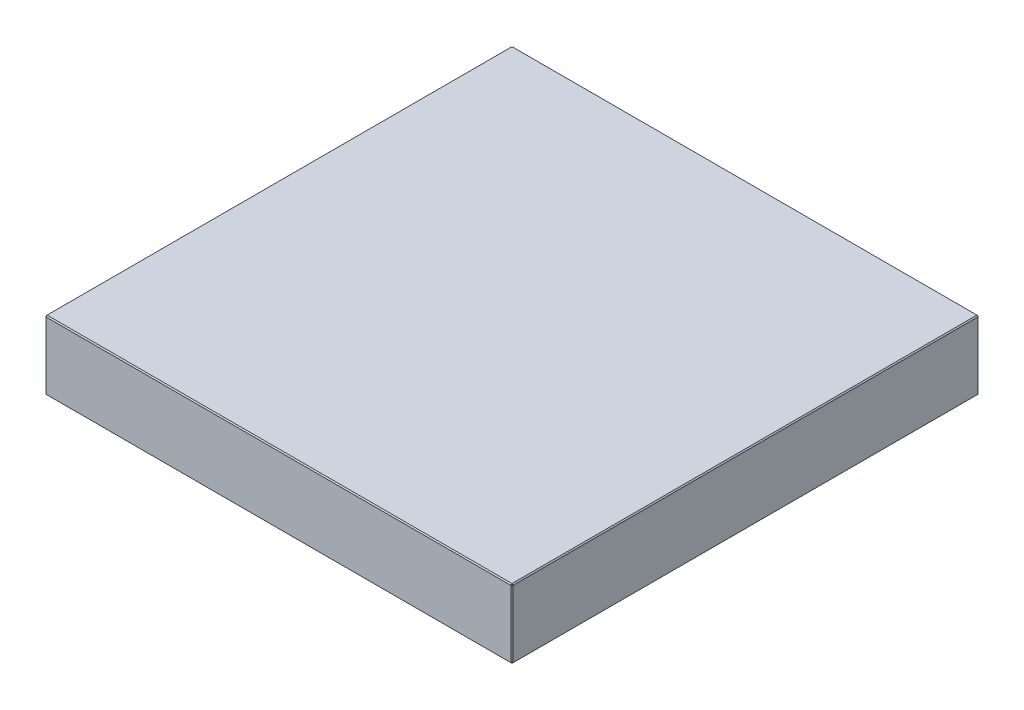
ISO-10303-21;
HEADER;
FILE_DESCRIPTION(('STEP AP214'),'2;1');
FILE_NAME('part.step','',(''),(''),'','','');
FILE_SCHEMA(('AUTOMOTIVE_DESIGN { 1 0 10303 214 1 1 1 1 }'));
ENDSEC;
DATA;
#1=APPLICATION_CONTEXT('core data for automotive mechanical design processes');
#2=APPLICATION_PROTOCOL_DEFINITION('international standard','automotive_design',2000,#1);
#3=PRODUCT_CONTEXT('',#1,'mechanical');
#4=PRODUCT('Part','Part','',(#3));
#5=PRODUCT_RELATED_PRODUCT_CATEGORY('part','',(#4));
#6=PRODUCT_DEFINITION_FORMATION('','',#4);
#7=PRODUCT_DEFINITION_CONTEXT('part definition',#1,'design');
#8=PRODUCT_DEFINITION('design','',#6,#7);
#9=PRODUCT_DEFINITION_SHAPE('','',#8);
#10=(LENGTH_UNIT() NAMED_UNIT(*) SI_UNIT(.MILLI.,.METRE.));
#11=(NAMED_UNIT(*) PLANE_ANGLE_UNIT() SI_UNIT($,.RADIAN.));
#12=(NAMED_UNIT(*) SI_UNIT($,.STERADIAN.) SOLID_ANGLE_UNIT());
#13=UNCERTAINTY_MEASURE_WITH_UNIT(LENGTH_MEASURE(1.E-05),#10,'distance_accuracy_value','');
#14=(GEOMETRIC_REPRESENTATION_CONTEXT(3) GLOBAL_UNCERTAINTY_ASSIGNED_CONTEXT((#13)) GLOBAL_UNIT_ASSIGNED_CONTEXT((#10,
#11,#12)) REPRESENTATION_CONTEXT('',''));
#15=CARTESIAN_POINT('',(0.,0.,0.));
#16=DIRECTION('',(0.,0.,1.));
#17=DIRECTION('',(1.,0.,0.));
#18=AXIS2_PLACEMENT_3D('',#15,#16,#17);
#19=CARTESIAN_POINT('',(-223.,66.,223.));
#20=DIRECTION('',(1.,0.,0.));
#21=DIRECTION('',(0.,0.,-1.));
#22=AXIS2_PLACEMENT_3D('',#19,#20,#21);
#23=PLANE('',#22);
#24=DIRECTION('',(0.,-1.,0.));
#25=VECTOR('',#24,1.);
#26=CARTESIAN_POINT('',(-223.,66.,-222.));
#27=LINE('',#26,#25);
#28=CARTESIAN_POINT('',(-223.,65.,-222.));
#29=VERTEX_POINT('',#28);
#30=CARTESIAN_POINT('',(-223.,1.,-222.));
#31=VERTEX_POINT('',#30);
#32=EDGE_CURVE('E114',#29,#31,#27,.T.);
#33=ORIENTED_EDGE('',*,*,#32,.T.);
#34=DIRECTION('',(0.,0.,1.));
#35=VECTOR('',#34,1.);
#36=CARTESIAN_POINT('',(-223.,1.,223.));
#37=LINE('',#36,#35);
#38=CARTESIAN_POINT('',(-223.,1.,222.));
#39=VERTEX_POINT('',#38);
#40=EDGE_CURVE('E110',#31,#39,#37,.T.);
#41=ORIENTED_EDGE('',*,*,#40,.T.);
#42=DIRECTION('',(0.,1.,0.));
#43=VECTOR('',#42,1.);
#44=CARTESIAN_POINT('',(-223.,66.,222.));
#45=LINE('',#44,#43);
#46=CARTESIAN_POINT('',(-223.,65.,222.));
#47=VERTEX_POINT('',#46);
#48=EDGE_CURVE('E103',#39,#47,#45,.T.);
#49=ORIENTED_EDGE('',*,*,#48,.T.);
#50=DIRECTION('',(0.,0.,-1.));
#51=VECTOR('',#50,1.);
#52=CARTESIAN_POINT('',(-223.,65.,-223.));
#53=LINE('',#52,#51);
#54=EDGE_CURVE('E107',#47,#29,#53,.T.);
#55=ORIENTED_EDGE('',*,*,#54,.T.);
#56=EDGE_LOOP('',(#33,#41,#49,#55));
#57=FACE_BOUND('',#56,.T.);
#58=ADVANCED_FACE('F15',(#57),#23,.F.);
#59=CARTESIAN_POINT('',(223.,66.,223.));
#60=DIRECTION('',(0.,0.,-1.));
#61=DIRECTION('',(-1.,0.,0.));
#62=AXIS2_PLACEMENT_3D('',#59,#60,#61);
#63=PLANE('',#62);
#64=DIRECTION('',(-1.,0.,0.));
#65=VECTOR('',#64,1.);
#66=CARTESIAN_POINT('',(-223.,65.,223.));
#67=LINE('',#66,#65);
#68=CARTESIAN_POINT('',(222.,65.,223.));
#69=VERTEX_POINT('',#68);
#70=CARTESIAN_POINT('',(-222.,65.,223.));
#71=VERTEX_POINT('',#70);
#72=EDGE_CURVE('E164',#69,#71,#67,.T.);
#73=ORIENTED_EDGE('',*,*,#72,.T.);
#74=DIRECTION('',(0.,-1.,0.));
#75=VECTOR('',#74,1.);
#76=CARTESIAN_POINT('',(-222.,66.,223.));
#77=LINE('',#76,#75);
#78=CARTESIAN_POINT('',(-222.,1.,223.));
#79=VERTEX_POINT('',#78);
#80=EDGE_CURVE('E122',#71,#79,#77,.T.);
#81=ORIENTED_EDGE('',*,*,#80,.T.);
#82=DIRECTION('',(1.,0.,0.));
#83=VECTOR('',#82,1.);
#84=CARTESIAN_POINT('',(223.,1.,223.));
#85=LINE('',#84,#83);
#86=CARTESIAN_POINT('',(222.,1.,223.));
#87=VERTEX_POINT('',#86);
#88=EDGE_CURVE('E168',#79,#87,#85,.T.);
#89=ORIENTED_EDGE('',*,*,#88,.T.);
#90=DIRECTION('',(0.,1.,0.));
#91=VECTOR('',#90,1.);
#92=CARTESIAN_POINT('',(222.,66.,223.));
#93=LINE('',#92,#91);
#94=EDGE_CURVE('E166',#87,#69,#93,.T.);
#95=ORIENTED_EDGE('',*,*,#94,.T.);
#96=EDGE_LOOP('',(#73,#81,#89,#95));
#97=FACE_BOUND('',#96,.T.);
#98=ADVANCED_FACE('F275',(#97),#63,.F.);
#99=CARTESIAN_POINT('',(223.,66.,223.));
#100=DIRECTION('',(-1.,0.,0.));
#101=DIRECTION('',(0.,0.,1.));
#102=AXIS2_PLACEMENT_3D('',#99,#100,#101);
#103=PLANE('',#102);
#104=DIRECTION('',(0.,0.,-1.));
#105=VECTOR('',#104,1.);
#106=CARTESIAN_POINT('',(223.,1.,223.));
#107=LINE('',#106,#105);
#108=CARTESIAN_POINT('',(223.,1.,222.));
#109=VERTEX_POINT('',#108);
#110=CARTESIAN_POINT('',(223.,1.,-222.));
#111=VERTEX_POINT('',#110);
#112=EDGE_CURVE('E159',#109,#111,#107,.T.);
#113=ORIENTED_EDGE('',*,*,#112,.T.);
#114=DIRECTION('',(0.,1.,0.));
#115=VECTOR('',#114,1.);
#116=CARTESIAN_POINT('',(223.,66.,-222.));
#117=LINE('',#116,#115);
#118=CARTESIAN_POINT('',(223.,65.,-222.));
#119=VERTEX_POINT('',#118);
#120=EDGE_CURVE('E161',#111,#119,#117,.T.);
#121=ORIENTED_EDGE('',*,*,#120,.T.);
#122=DIRECTION('',(0.,0.,1.));
#123=VECTOR('',#122,1.);
#124=CARTESIAN_POINT('',(223.,65.,223.));
#125=LINE('',#124,#123);
#126=CARTESIAN_POINT('',(223.,65.,222.));
#127=VERTEX_POINT('',#126);
#128=EDGE_CURVE('E155',#119,#127,#125,.T.);
#129=ORIENTED_EDGE('',*,*,#128,.T.);
#130=DIRECTION('',(0.,-1.,0.));
#131=VECTOR('',#130,1.);
#132=CARTESIAN_POINT('',(223.,66.,222.));
#133=LINE('',#132,#131);
#134=EDGE_CURVE('E157',#127,#109,#133,.T.);
#135=ORIENTED_EDGE('',*,*,#134,.T.);
#136=EDGE_LOOP('',(#113,#121,#129,#135));
#137=FACE_BOUND('',#136,.T.);
#138=ADVANCED_FACE('F254',(#137),#103,.F.);
#139=CARTESIAN_POINT('',(223.,66.,-223.));
#140=DIRECTION('',(0.,0.,1.));
#141=DIRECTION('',(1.,0.,0.));
#142=AXIS2_PLACEMENT_3D('',#139,#140,#141);
#143=PLANE('',#142);
#144=DIRECTION('',(0.,-1.,0.));
#145=VECTOR('',#144,1.);
#146=CARTESIAN_POINT('',(222.,66.,-223.));
#147=LINE('',#146,#145);
#148=CARTESIAN_POINT('',(222.,65.,-223.));
#149=VERTEX_POINT('',#148);
#150=CARTESIAN_POINT('',(222.,1.,-223.));
#151=VERTEX_POINT('',#150);
#152=EDGE_CURVE('E148',#149,#151,#147,.T.);
#153=ORIENTED_EDGE('',*,*,#152,.T.);
#154=DIRECTION('',(-1.,0.,0.));
#155=VECTOR('',#154,1.);
#156=CARTESIAN_POINT('',(223.,1.,-223.));
#157=LINE('',#156,#155);
#158=CARTESIAN_POINT('',(-222.,1.,-223.));
#159=VERTEX_POINT('',#158);
#160=EDGE_CURVE('E153',#151,#159,#157,.T.);
#161=ORIENTED_EDGE('',*,*,#160,.T.);
#162=DIRECTION('',(0.,1.,0.));
#163=VECTOR('',#162,1.);
#164=CARTESIAN_POINT('',(-222.,66.,-223.));
#165=LINE('',#164,#163);
#166=CARTESIAN_POINT('',(-222.,65.,-223.));
#167=VERTEX_POINT('',#166);
#168=EDGE_CURVE('E150',#159,#167,#165,.T.);
#169=ORIENTED_EDGE('',*,*,#168,.T.);
#170=DIRECTION('',(1.,0.,0.));
#171=VECTOR('',#170,1.);
#172=CARTESIAN_POINT('',(223.,65.,-223.));
#173=LINE('',#172,#171);
#174=EDGE_CURVE('E146',#167,#149,#173,.T.);
#175=ORIENTED_EDGE('',*,*,#174,.T.);
#176=EDGE_LOOP('',(#153,#161,#169,#175));
#177=FACE_BOUND('',#176,.T.);
#178=ADVANCED_FACE('F284',(#177),#143,.F.);
#179=CARTESIAN_POINT('',(0.,66.,0.));
#180=DIRECTION('',(0.,1.,0.));
#181=DIRECTION('',(0.,0.,1.));
#182=AXIS2_PLACEMENT_3D('',#179,#180,#181);
#183=PLANE('',#182);
#184=DIRECTION('',(0.,0.,-1.));
#185=VECTOR('',#184,1.);
#186=CARTESIAN_POINT('',(222.,66.,-223.));
#187=LINE('',#186,#185);
#188=CARTESIAN_POINT('',(222.,66.,222.));
#189=VERTEX_POINT('',#188);
#190=CARTESIAN_POINT('',(222.,66.,-222.));
#191=VERTEX_POINT('',#190);
#192=EDGE_CURVE('E24',#189,#191,#187,.T.);
#193=ORIENTED_EDGE('',*,*,#192,.T.);
#194=DIRECTION('',(-1.,0.,0.));
#195=VECTOR('',#194,1.);
#196=CARTESIAN_POINT('',(-223.,66.,-222.));
#197=LINE('',#196,#195);
#198=CARTESIAN_POINT('',(-222.,66.,-222.));
#199=VERTEX_POINT('',#198);
#200=EDGE_CURVE('E9',#191,#199,#197,.T.);
#201=ORIENTED_EDGE('',*,*,#200,.T.);
#202=DIRECTION('',(0.,0.,1.));
#203=VECTOR('',#202,1.);
#204=CARTESIAN_POINT('',(-222.,66.,223.));
#205=LINE('',#204,#203);
#206=CARTESIAN_POINT('',(-222.,66.,222.));
#207=VERTEX_POINT('',#206);
#208=EDGE_CURVE('E180',#199,#207,#205,.T.);
#209=ORIENTED_EDGE('',*,*,#208,.T.);
#210=DIRECTION('',(1.,0.,0.));
#211=VECTOR('',#210,1.);
#212=CARTESIAN_POINT('',(223.,66.,222.));
#213=LINE('',#212,#211);
#214=EDGE_CURVE('E35',#207,#189,#213,.T.);
#215=ORIENTED_EDGE('',*,*,#214,.T.);
#216=EDGE_LOOP('',(#193,#201,#209,#215));
#217=FACE_BOUND('',#216,.T.);
#218=ADVANCED_FACE('F350',(#217),#183,.T.);
#219=CARTESIAN_POINT('',(0.,0.,0.));
#220=DIRECTION('',(0.,1.,0.));
#221=DIRECTION('',(0.,0.,1.));
#222=AXIS2_PLACEMENT_3D('',#219,#220,#221);
#223=PLANE('',#222);
#224=DIRECTION('',(0.,0.,1.));
#225=VECTOR('',#224,1.);
#226=CARTESIAN_POINT('',(222.,0.,0.));
#227=LINE('',#226,#225);
#228=CARTESIAN_POINT('',(222.,0.,-222.));
#229=VERTEX_POINT('',#228);
#230=CARTESIAN_POINT('',(222.,0.,222.));
#231=VERTEX_POINT('',#230);
#232=EDGE_CURVE('E171',#229,#231,#227,.T.);
#233=ORIENTED_EDGE('',*,*,#232,.T.);
#234=DIRECTION('',(-1.,0.,0.));
#235=VECTOR('',#234,1.);
#236=CARTESIAN_POINT('',(0.,0.,222.));
#237=LINE('',#236,#235);
#238=CARTESIAN_POINT('',(-222.,0.,222.));
#239=VERTEX_POINT('',#238);
#240=EDGE_CURVE('E177',#231,#239,#237,.T.);
#241=ORIENTED_EDGE('',*,*,#240,.T.);
#242=DIRECTION('',(0.,0.,-1.));
#243=VECTOR('',#242,1.);
#244=CARTESIAN_POINT('',(-222.,0.,0.));
#245=LINE('',#244,#243);
#246=CARTESIAN_POINT('',(-222.,0.,-222.));
#247=VERTEX_POINT('',#246);
#248=EDGE_CURVE('E175',#239,#247,#245,.T.);
#249=ORIENTED_EDGE('',*,*,#248,.T.);
#250=DIRECTION('',(1.,0.,0.));
#251=VECTOR('',#250,1.);
#252=CARTESIAN_POINT('',(0.,0.,-222.));
#253=LINE('',#252,#251);
#254=EDGE_CURVE('E173',#247,#229,#253,.T.);
#255=ORIENTED_EDGE('',*,*,#254,.T.);
#256=EDGE_LOOP('',(#233,#241,#249,#255));
#257=FACE_BOUND('',#256,.T.);
#258=ADVANCED_FACE('F246',(#257),#223,.F.);
#259=CARTESIAN_POINT('',(223.,66.,222.));
#260=DIRECTION('',(-0.707106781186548,0.,-0.707106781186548));
#261=DIRECTION('',(0.,-1.,0.));
#262=AXIS2_PLACEMENT_3D('',#259,#260,#261);
#263=PLANE('',#262);
#264=DIRECTION('',(-0.707106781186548,0.,0.707106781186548));
#265=VECTOR('',#264,1.);
#266=CARTESIAN_POINT('',(222.,65.,223.));
#267=LINE('',#266,#265);
#268=EDGE_CURVE('E19',#69,#127,#267,.F.);
#269=ORIENTED_EDGE('',*,*,#268,.F.);
#270=ORIENTED_EDGE('',*,*,#94,.F.);
#271=DIRECTION('',(0.707106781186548,0.,-0.707106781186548));
#272=VECTOR('',#271,1.);
#273=CARTESIAN_POINT('',(222.,1.,223.));
#274=LINE('',#273,#272);
#275=EDGE_CURVE('E142',#109,#87,#274,.F.);
#276=ORIENTED_EDGE('',*,*,#275,.F.);
#277=ORIENTED_EDGE('',*,*,#134,.F.);
#278=EDGE_LOOP('',(#269,#270,#276,#277));
#279=FACE_BOUND('',#278,.T.);
#280=ADVANCED_FACE('F17',(#279),#263,.F.);
#281=CARTESIAN_POINT('',(222.,65.,223.));
#282=DIRECTION('',(0.577350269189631,0.577350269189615,0.577350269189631));
#283=DIRECTION('',(0.707106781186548,0.,-0.707106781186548));
#284=AXIS2_PLACEMENT_3D('',#281,#282,#283);
#285=PLANE('',#284);
#286=DIRECTION('',(0.,-0.707106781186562,0.707106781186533));
#287=VECTOR('',#286,1.);
#288=CARTESIAN_POINT('',(222.,65.,223.));
#289=LINE('',#288,#287);
#290=EDGE_CURVE('E226',#69,#189,#289,.F.);
#291=ORIENTED_EDGE('',*,*,#290,.F.);
#292=ORIENTED_EDGE('',*,*,#268,.T.);
#293=DIRECTION('',(-0.707106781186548,0.707106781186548,0.));
#294=VECTOR('',#293,1.);
#295=CARTESIAN_POINT('',(222.5,65.5,222.));
#296=LINE('',#295,#294);
#297=EDGE_CURVE('E228',#189,#127,#296,.F.);
#298=ORIENTED_EDGE('',*,*,#297,.F.);
#299=EDGE_LOOP('',(#291,#292,#298));
#300=FACE_BOUND('',#299,.T.);
#301=ADVANCED_FACE('F270',(#300),#285,.T.);
#302=CARTESIAN_POINT('',(222.,1.,223.));
#303=DIRECTION('',(0.577350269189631,-0.577350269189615,0.577350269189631));
#304=DIRECTION('',(0.707106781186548,0.,-0.707106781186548));
#305=AXIS2_PLACEMENT_3D('',#302,#303,#304);
#306=PLANE('',#305);
#307=DIRECTION('',(-0.707106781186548,-0.707106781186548,0.));
#308=VECTOR('',#307,1.);
#309=CARTESIAN_POINT('',(222.5,0.499999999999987,222.));
#310=LINE('',#309,#308);
#311=EDGE_CURVE('E220',#109,#231,#310,.T.);
#312=ORIENTED_EDGE('',*,*,#311,.F.);
#313=ORIENTED_EDGE('',*,*,#275,.T.);
#314=DIRECTION('',(0.,0.707106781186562,0.707106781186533));
#315=VECTOR('',#314,1.);
#316=CARTESIAN_POINT('',(222.,1.,223.));
#317=LINE('',#316,#315);
#318=EDGE_CURVE('E223',#231,#87,#317,.T.);
#319=ORIENTED_EDGE('',*,*,#318,.F.);
#320=EDGE_LOOP('',(#312,#313,#319));
#321=FACE_BOUND('',#320,.T.);
#322=ADVANCED_FACE('F235',(#321),#306,.T.);
#323=CARTESIAN_POINT('',(222.,66.,0.));
#324=DIRECTION('',(0.707106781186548,0.707106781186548,0.));
#325=DIRECTION('',(0.,0.,1.));
#326=AXIS2_PLACEMENT_3D('',#323,#324,#325);
#327=PLANE('',#326);
#328=ORIENTED_EDGE('',*,*,#297,.T.);
#329=ORIENTED_EDGE('',*,*,#128,.F.);
#330=DIRECTION('',(0.707106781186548,-0.707106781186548,0.));
#331=VECTOR('',#330,1.);
#332=CARTESIAN_POINT('',(223.,65.,-222.));
#333=LINE('',#332,#331);
#334=EDGE_CURVE('E215',#191,#119,#333,.T.);
#335=ORIENTED_EDGE('',*,*,#334,.F.);
#336=ORIENTED_EDGE('',*,*,#192,.F.);
#337=EDGE_LOOP('',(#328,#329,#335,#336));
#338=FACE_BOUND('',#337,.T.);
#339=ADVANCED_FACE('F265',(#338),#327,.T.);
#340=CARTESIAN_POINT('',(0.,66.,222.));
#341=DIRECTION('',(0.,0.707106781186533,0.707106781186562));
#342=DIRECTION('',(-1.,0.,0.));
#343=AXIS2_PLACEMENT_3D('',#340,#341,#342);
#344=PLANE('',#343);
#345=ORIENTED_EDGE('',*,*,#290,.T.);
#346=ORIENTED_EDGE('',*,*,#214,.F.);
#347=DIRECTION('',(0.,0.707106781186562,-0.707106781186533));
#348=VECTOR('',#347,1.);
#349=CARTESIAN_POINT('',(-222.,65.5,222.5));
#350=LINE('',#349,#348);
#351=EDGE_CURVE('E126',#71,#207,#350,.T.);
#352=ORIENTED_EDGE('',*,*,#351,.F.);
#353=ORIENTED_EDGE('',*,*,#72,.F.);
#354=EDGE_LOOP('',(#345,#346,#352,#353));
#355=FACE_BOUND('',#354,.T.);
#356=ADVANCED_FACE('F273',(#355),#344,.T.);
#357=CARTESIAN_POINT('',(-222.,66.,223.));
#358=DIRECTION('',(0.707106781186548,0.,-0.707106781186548));
#359=DIRECTION('',(0.,-1.,0.));
#360=AXIS2_PLACEMENT_3D('',#357,#358,#359);
#361=PLANE('',#360);
#362=DIRECTION('',(0.707106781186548,0.,0.707106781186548));
#363=VECTOR('',#362,1.);
#364=CARTESIAN_POINT('',(-222.,1.,223.));
#365=LINE('',#364,#363);
#366=EDGE_CURVE('E127',#79,#39,#365,.F.);
#367=ORIENTED_EDGE('',*,*,#366,.F.);
#368=ORIENTED_EDGE('',*,*,#80,.F.);
#369=DIRECTION('',(-0.707106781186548,0.,-0.707106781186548));
#370=VECTOR('',#369,1.);
#371=CARTESIAN_POINT('',(-223.,65.,222.));
#372=LINE('',#371,#370);
#373=EDGE_CURVE('E118',#47,#71,#372,.F.);
#374=ORIENTED_EDGE('',*,*,#373,.F.);
#375=ORIENTED_EDGE('',*,*,#48,.F.);
#376=EDGE_LOOP('',(#367,#368,#374,#375));
#377=FACE_BOUND('',#376,.T.);
#378=ADVANCED_FACE('F120',(#377),#361,.F.);
#379=CARTESIAN_POINT('',(223.,1.,223.));
#380=DIRECTION('',(0.,0.707106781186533,-0.707106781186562));
#381=DIRECTION('',(1.,0.,0.));
#382=AXIS2_PLACEMENT_3D('',#379,#380,#381);
#383=PLANE('',#382);
#384=ORIENTED_EDGE('',*,*,#318,.T.);
#385=ORIENTED_EDGE('',*,*,#88,.F.);
#386=DIRECTION('',(0.,-0.707106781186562,-0.707106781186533));
#387=VECTOR('',#386,1.);
#388=CARTESIAN_POINT('',(-222.,1.,223.));
#389=LINE('',#388,#387);
#390=EDGE_CURVE('E211',#239,#79,#389,.F.);
#391=ORIENTED_EDGE('',*,*,#390,.F.);
#392=ORIENTED_EDGE('',*,*,#240,.F.);
#393=EDGE_LOOP('',(#384,#385,#391,#392));
#394=FACE_BOUND('',#393,.T.);
#395=ADVANCED_FACE('F243',(#394),#383,.F.);
#396=CARTESIAN_POINT('',(223.,1.,223.));
#397=DIRECTION('',(-0.707106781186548,0.707106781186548,0.));
#398=DIRECTION('',(0.,0.,-1.));
#399=AXIS2_PLACEMENT_3D('',#396,#397,#398);
#400=PLANE('',#399);
#401=ORIENTED_EDGE('',*,*,#311,.T.);
#402=ORIENTED_EDGE('',*,*,#232,.F.);
#403=DIRECTION('',(0.707106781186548,0.707106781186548,0.));
#404=VECTOR('',#403,1.);
#405=CARTESIAN_POINT('',(222.5,0.499999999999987,-222.));
#406=LINE('',#405,#404);
#407=EDGE_CURVE('E208',#111,#229,#406,.F.);
#408=ORIENTED_EDGE('',*,*,#407,.F.);
#409=ORIENTED_EDGE('',*,*,#112,.F.);
#410=EDGE_LOOP('',(#401,#402,#408,#409));
#411=FACE_BOUND('',#410,.T.);
#412=ADVANCED_FACE('F251',(#411),#400,.F.);
#413=CARTESIAN_POINT('',(222.,66.,-223.));
#414=DIRECTION('',(-0.707106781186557,0.,0.707106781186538));
#415=DIRECTION('',(0.,-1.,0.));
#416=AXIS2_PLACEMENT_3D('',#413,#414,#415);
#417=PLANE('',#416);
#418=DIRECTION('',(0.707106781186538,0.,0.707106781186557));
#419=VECTOR('',#418,1.);
#420=CARTESIAN_POINT('',(223.,65.,-222.));
#421=LINE('',#420,#419);
#422=EDGE_CURVE('E217',#119,#149,#421,.F.);
#423=ORIENTED_EDGE('',*,*,#422,.F.);
#424=ORIENTED_EDGE('',*,*,#120,.F.);
#425=DIRECTION('',(-0.707106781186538,0.,-0.707106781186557));
#426=VECTOR('',#425,1.);
#427=CARTESIAN_POINT('',(222.,1.,-223.));
#428=LINE('',#427,#426);
#429=EDGE_CURVE('E205',#151,#111,#428,.F.);
#430=ORIENTED_EDGE('',*,*,#429,.F.);
#431=ORIENTED_EDGE('',*,*,#152,.F.);
#432=EDGE_LOOP('',(#423,#424,#430,#431));
#433=FACE_BOUND('',#432,.T.);
#434=ADVANCED_FACE('F258',(#433),#417,.F.);
#435=CARTESIAN_POINT('',(223.,65.,-222.));
#436=DIRECTION('',(0.577350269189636,0.57735026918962,-0.57735026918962));
#437=DIRECTION('',(-0.707106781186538,0.,-0.707106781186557));
#438=AXIS2_PLACEMENT_3D('',#435,#436,#437);
#439=PLANE('',#438);
#440=ORIENTED_EDGE('',*,*,#334,.T.);
#441=ORIENTED_EDGE('',*,*,#422,.T.);
#442=DIRECTION('',(0.,0.707106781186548,0.707106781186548));
#443=VECTOR('',#442,1.);
#444=CARTESIAN_POINT('',(222.,65.5,-222.5));
#445=LINE('',#444,#443);
#446=EDGE_CURVE('E134',#191,#149,#445,.F.);
#447=ORIENTED_EDGE('',*,*,#446,.F.);
#448=EDGE_LOOP('',(#440,#441,#447));
#449=FACE_BOUND('',#448,.T.);
#450=ADVANCED_FACE('F325',(#449),#439,.T.);
#451=CARTESIAN_POINT('',(-223.,65.,222.));
#452=DIRECTION('',(-0.577350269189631,0.577350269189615,0.577350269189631));
#453=DIRECTION('',(0.707106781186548,0.,0.707106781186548));
#454=AXIS2_PLACEMENT_3D('',#451,#452,#453);
#455=PLANE('',#454);
#456=ORIENTED_EDGE('',*,*,#373,.T.);
#457=ORIENTED_EDGE('',*,*,#351,.T.);
#458=DIRECTION('',(-0.707106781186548,-0.707106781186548,0.));
#459=VECTOR('',#458,1.);
#460=CARTESIAN_POINT('',(-223.,65.,222.));
#461=LINE('',#460,#459);
#462=EDGE_CURVE('E130',#47,#207,#461,.F.);
#463=ORIENTED_EDGE('',*,*,#462,.F.);
#464=EDGE_LOOP('',(#456,#457,#463));
#465=FACE_BOUND('',#464,.T.);
#466=ADVANCED_FACE('F131',(#465),#455,.T.);
#467=CARTESIAN_POINT('',(-222.,1.,223.));
#468=DIRECTION('',(-0.577350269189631,-0.577350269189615,0.577350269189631));
#469=DIRECTION('',(0.707106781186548,0.,0.707106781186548));
#470=AXIS2_PLACEMENT_3D('',#467,#468,#469);
#471=PLANE('',#470);
#472=ORIENTED_EDGE('',*,*,#390,.T.);
#473=ORIENTED_EDGE('',*,*,#366,.T.);
#474=DIRECTION('',(-0.707106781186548,0.707106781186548,0.));
#475=VECTOR('',#474,1.);
#476=CARTESIAN_POINT('',(-222.5,0.499999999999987,222.));
#477=LINE('',#476,#475);
#478=EDGE_CURVE('E135',#239,#39,#477,.T.);
#479=ORIENTED_EDGE('',*,*,#478,.F.);
#480=EDGE_LOOP('',(#472,#473,#479));
#481=FACE_BOUND('',#480,.T.);
#482=ADVANCED_FACE('F318',(#481),#471,.T.);
#483=CARTESIAN_POINT('',(222.,1.,-223.));
#484=DIRECTION('',(0.577350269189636,-0.57735026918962,-0.57735026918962));
#485=DIRECTION('',(-0.707106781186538,0.,-0.707106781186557));
#486=AXIS2_PLACEMENT_3D('',#483,#484,#485);
#487=PLANE('',#486);
#488=ORIENTED_EDGE('',*,*,#429,.T.);
#489=ORIENTED_EDGE('',*,*,#407,.T.);
#490=DIRECTION('',(0.,-0.707106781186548,0.707106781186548));
#491=VECTOR('',#490,1.);
#492=CARTESIAN_POINT('',(222.,1.,-223.));
#493=LINE('',#492,#491);
#494=EDGE_CURVE('E198',#151,#229,#493,.T.);
#495=ORIENTED_EDGE('',*,*,#494,.F.);
#496=EDGE_LOOP('',(#488,#489,#495));
#497=FACE_BOUND('',#496,.T.);
#498=ADVANCED_FACE('F314',(#497),#487,.T.);
#499=CARTESIAN_POINT('',(0.,66.,-222.));
#500=DIRECTION('',(0.,0.707106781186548,-0.707106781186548));
#501=DIRECTION('',(1.,0.,0.));
#502=AXIS2_PLACEMENT_3D('',#499,#500,#501);
#503=PLANE('',#502);
#504=ORIENTED_EDGE('',*,*,#446,.T.);
#505=ORIENTED_EDGE('',*,*,#174,.F.);
#506=DIRECTION('',(0.,-0.707106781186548,-0.707106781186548));
#507=VECTOR('',#506,1.);
#508=CARTESIAN_POINT('',(-222.,65.,-223.));
#509=LINE('',#508,#507);
#510=EDGE_CURVE('E195',#199,#167,#509,.T.);
#511=ORIENTED_EDGE('',*,*,#510,.F.);
#512=ORIENTED_EDGE('',*,*,#200,.F.);
#513=EDGE_LOOP('',(#504,#505,#511,#512));
#514=FACE_BOUND('',#513,.T.);
#515=ADVANCED_FACE('F311',(#514),#503,.T.);
#516=CARTESIAN_POINT('',(-222.,66.,0.));
#517=DIRECTION('',(-0.707106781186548,0.707106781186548,0.));
#518=DIRECTION('',(0.,0.,-1.));
#519=AXIS2_PLACEMENT_3D('',#516,#517,#518);
#520=PLANE('',#519);
#521=ORIENTED_EDGE('',*,*,#462,.T.);
#522=ORIENTED_EDGE('',*,*,#208,.F.);
#523=DIRECTION('',(0.707106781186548,0.707106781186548,0.));
#524=VECTOR('',#523,1.);
#525=CARTESIAN_POINT('',(-222.5,65.5,-222.));
#526=LINE('',#525,#524);
#527=EDGE_CURVE('E138',#29,#199,#526,.T.);
#528=ORIENTED_EDGE('',*,*,#527,.F.);
#529=ORIENTED_EDGE('',*,*,#54,.F.);
#530=EDGE_LOOP('',(#521,#522,#528,#529));
#531=FACE_BOUND('',#530,.T.);
#532=ADVANCED_FACE('F137',(#531),#520,.T.);
#533=CARTESIAN_POINT('',(-223.,1.,223.));
#534=DIRECTION('',(0.707106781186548,0.707106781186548,0.));
#535=DIRECTION('',(0.,0.,1.));
#536=AXIS2_PLACEMENT_3D('',#533,#534,#535);
#537=PLANE('',#536);
#538=ORIENTED_EDGE('',*,*,#478,.T.);
#539=ORIENTED_EDGE('',*,*,#40,.F.);
#540=DIRECTION('',(0.707106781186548,-0.707106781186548,0.));
#541=VECTOR('',#540,1.);
#542=CARTESIAN_POINT('',(-223.,1.,-222.));
#543=LINE('',#542,#541);
#544=EDGE_CURVE('E191',#247,#31,#543,.F.);
#545=ORIENTED_EDGE('',*,*,#544,.F.);
#546=ORIENTED_EDGE('',*,*,#248,.F.);
#547=EDGE_LOOP('',(#538,#539,#545,#546));
#548=FACE_BOUND('',#547,.T.);
#549=ADVANCED_FACE('F304',(#548),#537,.F.);
#550=CARTESIAN_POINT('',(223.,1.,-223.));
#551=DIRECTION('',(0.,0.707106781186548,0.707106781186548));
#552=DIRECTION('',(-1.,0.,0.));
#553=AXIS2_PLACEMENT_3D('',#550,#551,#552);
#554=PLANE('',#553);
#555=ORIENTED_EDGE('',*,*,#494,.T.);
#556=ORIENTED_EDGE('',*,*,#254,.F.);
#557=DIRECTION('',(0.,0.707106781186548,-0.707106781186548));
#558=VECTOR('',#557,1.);
#559=CARTESIAN_POINT('',(-222.,0.5,-222.5));
#560=LINE('',#559,#558);
#561=EDGE_CURVE('E188',#159,#247,#560,.F.);
#562=ORIENTED_EDGE('',*,*,#561,.F.);
#563=ORIENTED_EDGE('',*,*,#160,.F.);
#564=EDGE_LOOP('',(#555,#556,#562,#563));
#565=FACE_BOUND('',#564,.T.);
#566=ADVANCED_FACE('F300',(#565),#554,.F.);
#567=CARTESIAN_POINT('',(-222.,65.,-223.));
#568=DIRECTION('',(-0.577350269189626,0.577350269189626,-0.577350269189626));
#569=DIRECTION('',(-0.707106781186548,0.,0.707106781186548));
#570=AXIS2_PLACEMENT_3D('',#567,#568,#569);
#571=PLANE('',#570);
#572=ORIENTED_EDGE('',*,*,#527,.T.);
#573=ORIENTED_EDGE('',*,*,#510,.T.);
#574=DIRECTION('',(0.707106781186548,0.,-0.707106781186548));
#575=VECTOR('',#574,1.);
#576=CARTESIAN_POINT('',(-222.,65.,-223.));
#577=LINE('',#576,#575);
#578=EDGE_CURVE('E186',#29,#167,#577,.T.);
#579=ORIENTED_EDGE('',*,*,#578,.F.);
#580=EDGE_LOOP('',(#572,#573,#579));
#581=FACE_BOUND('',#580,.T.);
#582=ADVANCED_FACE('F296',(#581),#571,.T.);
#583=CARTESIAN_POINT('',(-223.,1.,-222.));
#584=DIRECTION('',(-0.577350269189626,-0.577350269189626,-0.577350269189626));
#585=DIRECTION('',(-0.707106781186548,0.,0.707106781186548));
#586=AXIS2_PLACEMENT_3D('',#583,#584,#585);
#587=PLANE('',#586);
#588=ORIENTED_EDGE('',*,*,#561,.T.);
#589=ORIENTED_EDGE('',*,*,#544,.T.);
#590=DIRECTION('',(-0.707106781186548,0.,0.707106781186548));
#591=VECTOR('',#590,1.);
#592=CARTESIAN_POINT('',(-223.,1.,-222.));
#593=LINE('',#592,#591);
#594=EDGE_CURVE('E184',#159,#31,#593,.T.);
#595=ORIENTED_EDGE('',*,*,#594,.F.);
#596=EDGE_LOOP('',(#588,#589,#595));
#597=FACE_BOUND('',#596,.T.);
#598=ADVANCED_FACE('F292',(#597),#587,.T.);
#599=CARTESIAN_POINT('',(-223.,66.,-222.));
#600=DIRECTION('',(0.707106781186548,0.,0.707106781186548));
#601=DIRECTION('',(0.,-1.,0.));
#602=AXIS2_PLACEMENT_3D('',#599,#600,#601);
#603=PLANE('',#602);
#604=ORIENTED_EDGE('',*,*,#578,.T.);
#605=ORIENTED_EDGE('',*,*,#168,.F.);
#606=ORIENTED_EDGE('',*,*,#594,.T.);
#607=ORIENTED_EDGE('',*,*,#32,.F.);
#608=EDGE_LOOP('',(#604,#605,#606,#607));
#609=FACE_BOUND('',#608,.T.);
#610=ADVANCED_FACE('F289',(#609),#603,.F.);
#611=CLOSED_SHELL('',(#58,#98,#138,#178,#218,#258,#280,#301,#322,#339,#356,#378,#395,#412,#434,
#450,#466,#482,#498,#515,#532,#549,#566,#582,#598,#610));
#612=MANIFOLD_SOLID_BREP('B1',#611);
#613=ADVANCED_BREP_SHAPE_REPRESENTATION('',(#18,#612),#14);
#614=SHAPE_DEFINITION_REPRESENTATION(#9,#613);
ENDSEC;
END-ISO-10303-21;
